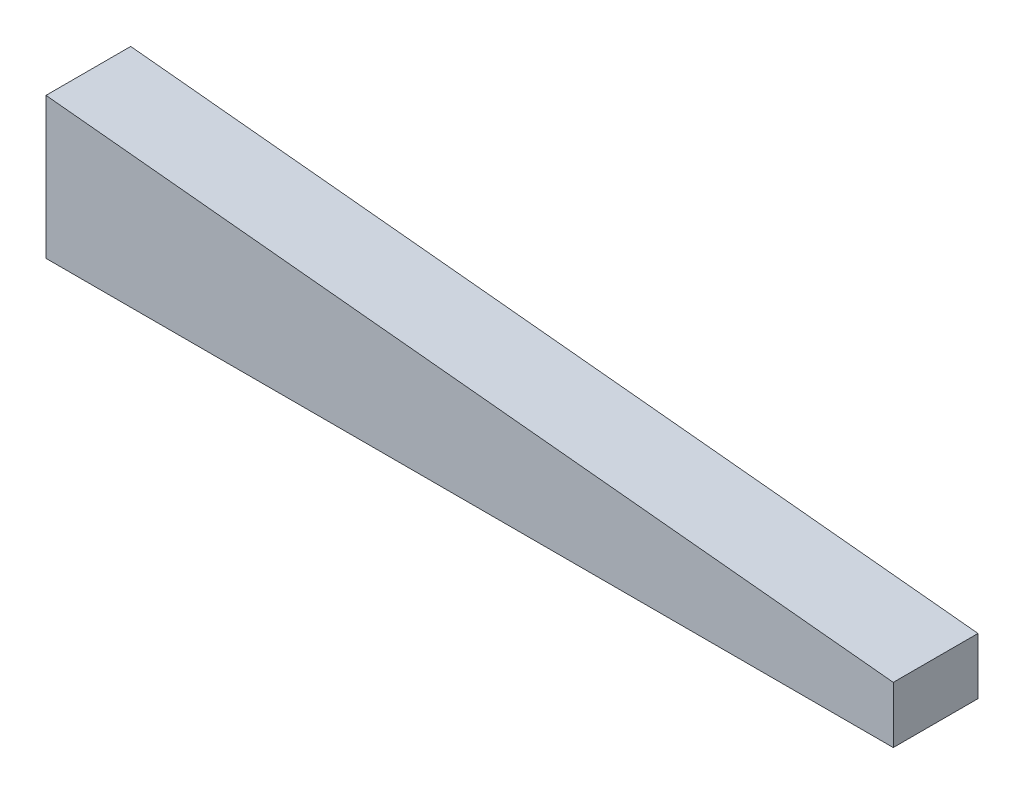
ISO-10303-21;
HEADER;
FILE_DESCRIPTION(('STEP AP214'),'2;1');
FILE_NAME('part.step','',(''),(''),'','','');
FILE_SCHEMA(('AUTOMOTIVE_DESIGN { 1 0 10303 214 1 1 1 1 }'));
ENDSEC;
DATA;
#1=APPLICATION_CONTEXT('core data for automotive mechanical design processes');
#2=APPLICATION_PROTOCOL_DEFINITION('international standard','automotive_design',2000,#1);
#3=PRODUCT_CONTEXT('',#1,'mechanical');
#4=PRODUCT('Part','Part','',(#3));
#5=PRODUCT_RELATED_PRODUCT_CATEGORY('part','',(#4));
#6=PRODUCT_DEFINITION_FORMATION('','',#4);
#7=PRODUCT_DEFINITION_CONTEXT('part definition',#1,'design');
#8=PRODUCT_DEFINITION('design','',#6,#7);
#9=PRODUCT_DEFINITION_SHAPE('','',#8);
#10=(LENGTH_UNIT() NAMED_UNIT(*) SI_UNIT(.MILLI.,.METRE.));
#11=(NAMED_UNIT(*) PLANE_ANGLE_UNIT() SI_UNIT($,.RADIAN.));
#12=(NAMED_UNIT(*) SI_UNIT($,.STERADIAN.) SOLID_ANGLE_UNIT());
#13=UNCERTAINTY_MEASURE_WITH_UNIT(LENGTH_MEASURE(1.E-05),#10,'distance_accuracy_value','');
#14=(GEOMETRIC_REPRESENTATION_CONTEXT(3) GLOBAL_UNCERTAINTY_ASSIGNED_CONTEXT((#13)) GLOBAL_UNIT_ASSIGNED_CONTEXT((#10,
#11,#12)) REPRESENTATION_CONTEXT('',''));
#15=CARTESIAN_POINT('',(0.,0.,0.));
#16=DIRECTION('',(0.,0.,1.));
#17=DIRECTION('',(1.,0.,0.));
#18=AXIS2_PLACEMENT_3D('',#15,#16,#17);
#19=CARTESIAN_POINT('',(15.,-0.5,3.));
#20=DIRECTION('',(-1.,0.,0.));
#21=DIRECTION('',(0.,0.,1.));
#22=AXIS2_PLACEMENT_3D('',#19,#20,#21);
#23=PLANE('',#22);
#24=DIRECTION('',(0.,1.,0.));
#25=VECTOR('',#24,1.);
#26=CARTESIAN_POINT('',(15.,-0.5,0.));
#27=LINE('',#26,#25);
#28=CARTESIAN_POINT('',(15.,-2.5,0.));
#29=VERTEX_POINT('',#28);
#30=CARTESIAN_POINT('',(15.,-0.5,0.));
#31=VERTEX_POINT('',#30);
#32=EDGE_CURVE('E96',#29,#31,#27,.T.);
#33=ORIENTED_EDGE('',*,*,#32,.T.);
#34=DIRECTION('',(0.,0.,-1.));
#35=VECTOR('',#34,1.);
#36=CARTESIAN_POINT('',(15.,-0.5,3.));
#37=LINE('',#36,#35);
#38=CARTESIAN_POINT('',(15.,-0.5,3.));
#39=VERTEX_POINT('',#38);
#40=EDGE_CURVE('E11',#39,#31,#37,.T.);
#41=ORIENTED_EDGE('',*,*,#40,.F.);
#42=DIRECTION('',(0.,1.,0.));
#43=VECTOR('',#42,1.);
#44=CARTESIAN_POINT('',(15.,-0.5,3.));
#45=LINE('',#44,#43);
#46=CARTESIAN_POINT('',(15.,-2.5,3.));
#47=VERTEX_POINT('',#46);
#48=EDGE_CURVE('E84',#47,#39,#45,.T.);
#49=ORIENTED_EDGE('',*,*,#48,.F.);
#50=DIRECTION('',(0.,0.,-1.));
#51=VECTOR('',#50,1.);
#52=CARTESIAN_POINT('',(15.,-2.5,3.));
#53=LINE('',#52,#51);
#54=EDGE_CURVE('E92',#47,#29,#53,.T.);
#55=ORIENTED_EDGE('',*,*,#54,.T.);
#56=EDGE_LOOP('',(#33,#41,#49,#55));
#57=FACE_BOUND('',#56,.T.);
#58=ADVANCED_FACE('F33',(#57),#23,.F.);
#59=CARTESIAN_POINT('',(-15.,2.5,3.));
#60=DIRECTION('',(-0.0995037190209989,-0.995037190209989,0.));
#61=DIRECTION('',(0.995037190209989,-0.0995037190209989,0.));
#62=AXIS2_PLACEMENT_3D('',#59,#60,#61);
#63=PLANE('',#62);
#64=DIRECTION('',(-0.995037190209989,0.0995037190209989,0.));
#65=VECTOR('',#64,1.);
#66=CARTESIAN_POINT('',(-15.,2.5,0.));
#67=LINE('',#66,#65);
#68=CARTESIAN_POINT('',(-15.,2.5,0.));
#69=VERTEX_POINT('',#68);
#70=EDGE_CURVE('E88',#31,#69,#67,.T.);
#71=ORIENTED_EDGE('',*,*,#70,.T.);
#72=DIRECTION('',(0.,0.,-1.));
#73=VECTOR('',#72,1.);
#74=CARTESIAN_POINT('',(-15.,2.5,3.));
#75=LINE('',#74,#73);
#76=CARTESIAN_POINT('',(-15.,2.5,3.));
#77=VERTEX_POINT('',#76);
#78=EDGE_CURVE('E41',#77,#69,#75,.T.);
#79=ORIENTED_EDGE('',*,*,#78,.F.);
#80=DIRECTION('',(-0.995037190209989,0.0995037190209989,0.));
#81=VECTOR('',#80,1.);
#82=CARTESIAN_POINT('',(-15.,2.5,3.));
#83=LINE('',#82,#81);
#84=EDGE_CURVE('E79',#39,#77,#83,.T.);
#85=ORIENTED_EDGE('',*,*,#84,.F.);
#86=ORIENTED_EDGE('',*,*,#40,.T.);
#87=EDGE_LOOP('',(#71,#79,#85,#86));
#88=FACE_BOUND('',#87,.T.);
#89=ADVANCED_FACE('F87',(#88),#63,.F.);
#90=CARTESIAN_POINT('',(-15.,2.5,3.));
#91=DIRECTION('',(1.,0.,0.));
#92=DIRECTION('',(0.,0.,-1.));
#93=AXIS2_PLACEMENT_3D('',#90,#91,#92);
#94=PLANE('',#93);
#95=DIRECTION('',(0.,-1.,0.));
#96=VECTOR('',#95,1.);
#97=CARTESIAN_POINT('',(-15.,2.5,0.));
#98=LINE('',#97,#96);
#99=CARTESIAN_POINT('',(-15.,-2.5,0.));
#100=VERTEX_POINT('',#99);
#101=EDGE_CURVE('E66',#69,#100,#98,.T.);
#102=ORIENTED_EDGE('',*,*,#101,.T.);
#103=DIRECTION('',(0.,0.,-1.));
#104=VECTOR('',#103,1.);
#105=CARTESIAN_POINT('',(-15.,-2.5,3.));
#106=LINE('',#105,#104);
#107=CARTESIAN_POINT('',(-15.,-2.5,3.));
#108=VERTEX_POINT('',#107);
#109=EDGE_CURVE('E89',#108,#100,#106,.T.);
#110=ORIENTED_EDGE('',*,*,#109,.F.);
#111=DIRECTION('',(0.,-1.,0.));
#112=VECTOR('',#111,1.);
#113=CARTESIAN_POINT('',(-15.,2.5,3.));
#114=LINE('',#113,#112);
#115=EDGE_CURVE('E82',#77,#108,#114,.T.);
#116=ORIENTED_EDGE('',*,*,#115,.F.);
#117=ORIENTED_EDGE('',*,*,#78,.T.);
#118=EDGE_LOOP('',(#102,#110,#116,#117));
#119=FACE_BOUND('',#118,.T.);
#120=ADVANCED_FACE('F90',(#119),#94,.F.);
#121=CARTESIAN_POINT('',(-15.,-2.5,3.));
#122=DIRECTION('',(0.,1.,0.));
#123=DIRECTION('',(0.,0.,1.));
#124=AXIS2_PLACEMENT_3D('',#121,#122,#123);
#125=PLANE('',#124);
#126=DIRECTION('',(1.,0.,0.));
#127=VECTOR('',#126,1.);
#128=CARTESIAN_POINT('',(-15.,-2.5,0.));
#129=LINE('',#128,#127);
#130=EDGE_CURVE('E72',#100,#29,#129,.T.);
#131=ORIENTED_EDGE('',*,*,#130,.T.);
#132=ORIENTED_EDGE('',*,*,#54,.F.);
#133=DIRECTION('',(1.,0.,0.));
#134=VECTOR('',#133,1.);
#135=CARTESIAN_POINT('',(-15.,-2.5,3.));
#136=LINE('',#135,#134);
#137=EDGE_CURVE('E49',#108,#47,#136,.T.);
#138=ORIENTED_EDGE('',*,*,#137,.F.);
#139=ORIENTED_EDGE('',*,*,#109,.T.);
#140=EDGE_LOOP('',(#131,#132,#138,#139));
#141=FACE_BOUND('',#140,.T.);
#142=ADVANCED_FACE('F103',(#141),#125,.F.);
#143=CARTESIAN_POINT('',(0.,0.,3.));
#144=DIRECTION('',(0.,0.,1.));
#145=DIRECTION('',(1.,0.,0.));
#146=AXIS2_PLACEMENT_3D('',#143,#144,#145);
#147=PLANE('',#146);
#148=ORIENTED_EDGE('',*,*,#48,.T.);
#149=ORIENTED_EDGE('',*,*,#84,.T.);
#150=ORIENTED_EDGE('',*,*,#115,.T.);
#151=ORIENTED_EDGE('',*,*,#137,.T.);
#152=EDGE_LOOP('',(#148,#149,#150,#151));
#153=FACE_BOUND('',#152,.T.);
#154=ADVANCED_FACE('F80',(#153),#147,.T.);
#155=CARTESIAN_POINT('',(0.,0.,0.));
#156=DIRECTION('',(0.,0.,1.));
#157=DIRECTION('',(1.,0.,0.));
#158=AXIS2_PLACEMENT_3D('',#155,#156,#157);
#159=PLANE('',#158);
#160=ORIENTED_EDGE('',*,*,#32,.F.);
#161=ORIENTED_EDGE('',*,*,#130,.F.);
#162=ORIENTED_EDGE('',*,*,#101,.F.);
#163=ORIENTED_EDGE('',*,*,#70,.F.);
#164=EDGE_LOOP('',(#160,#161,#162,#163));
#165=FACE_BOUND('',#164,.T.);
#166=ADVANCED_FACE('F106',(#165),#159,.F.);
#167=CLOSED_SHELL('',(#58,#89,#120,#142,#154,#166));
#168=MANIFOLD_SOLID_BREP('B2',#167);
#169=ADVANCED_BREP_SHAPE_REPRESENTATION('',(#18,#168),#14);
#170=SHAPE_DEFINITION_REPRESENTATION(#9,#169);
ENDSEC;
END-ISO-10303-21;
